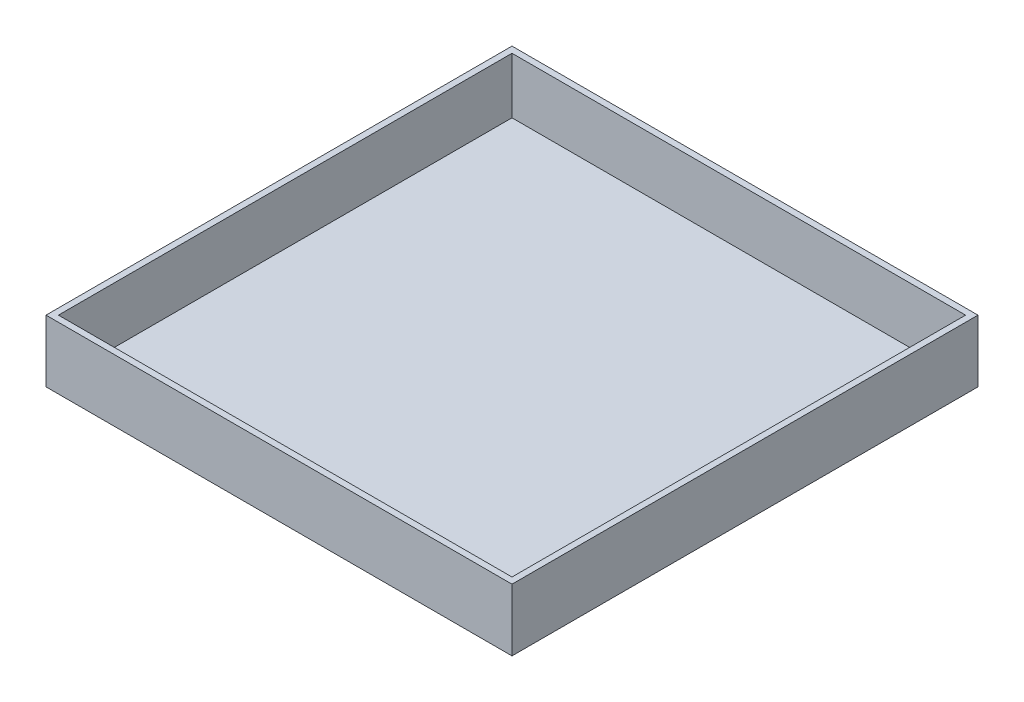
from build123d import *

# Parameters (mm, degrees)
SKETCH1_W      = 150
SKETCH1_H      = 150
EXTRUDE1_DEPTH = 20
SHELL1_T       = -2


with BuildPart() as part:
    # Sketch1 → Extrude1 (new body)
    with BuildSketch(Plane(origin=(0, 0, 0), x_dir=(1, 0, 0), z_dir=(0, 1, 0))):
        Rectangle(SKETCH1_W, SKETCH1_H)
    extrude(amount=EXTRUDE1_DEPTH)

    # Shell1
    shell1_openings = [part.faces().sort_by_distance(p)[0] for p in [
        (0, 20, 0),
    ]]
    offset(amount=SHELL1_T, openings=shell1_openings, kind=Kind.INTERSECTION)


solid = part.part
